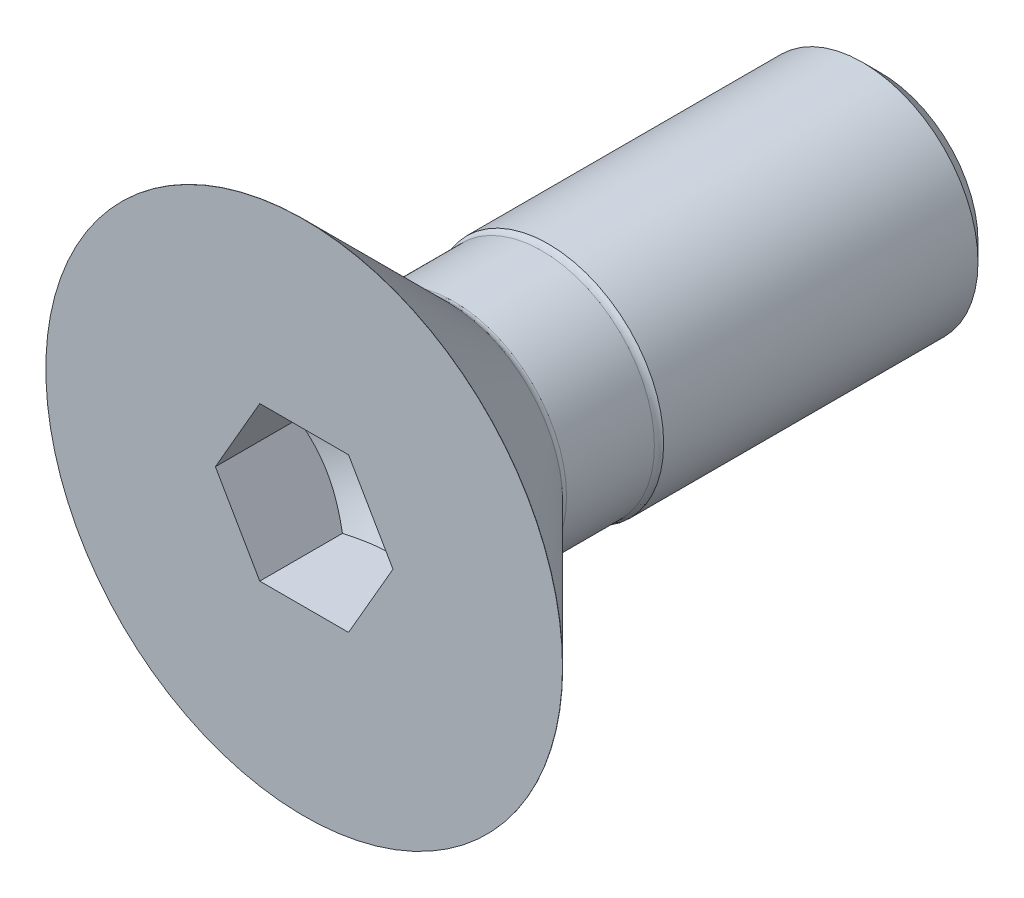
ISO-10303-21;
HEADER;
FILE_DESCRIPTION(('STEP AP214'),'2;1');
FILE_NAME('part.step','',(''),(''),'','','');
FILE_SCHEMA(('AUTOMOTIVE_DESIGN { 1 0 10303 214 1 1 1 1 }'));
ENDSEC;
DATA;
#1=APPLICATION_CONTEXT('core data for automotive mechanical design processes');
#2=APPLICATION_PROTOCOL_DEFINITION('international standard','automotive_design',2000,#1);
#3=PRODUCT_CONTEXT('',#1,'mechanical');
#4=PRODUCT('Part','Part','',(#3));
#5=PRODUCT_RELATED_PRODUCT_CATEGORY('part','',(#4));
#6=PRODUCT_DEFINITION_FORMATION('','',#4);
#7=PRODUCT_DEFINITION_CONTEXT('part definition',#1,'design');
#8=PRODUCT_DEFINITION('design','',#6,#7);
#9=PRODUCT_DEFINITION_SHAPE('','',#8);
#10=(LENGTH_UNIT() NAMED_UNIT(*) SI_UNIT(.MILLI.,.METRE.));
#11=(NAMED_UNIT(*) PLANE_ANGLE_UNIT() SI_UNIT($,.RADIAN.));
#12=(NAMED_UNIT(*) SI_UNIT($,.STERADIAN.) SOLID_ANGLE_UNIT());
#13=UNCERTAINTY_MEASURE_WITH_UNIT(LENGTH_MEASURE(1.E-05),#10,'distance_accuracy_value','');
#14=(GEOMETRIC_REPRESENTATION_CONTEXT(3) GLOBAL_UNCERTAINTY_ASSIGNED_CONTEXT((#13)) GLOBAL_UNIT_ASSIGNED_CONTEXT((#10,
#11,#12)) REPRESENTATION_CONTEXT('',''));
#15=CARTESIAN_POINT('',(0.,0.,0.));
#16=DIRECTION('',(0.,0.,1.));
#17=DIRECTION('',(1.,0.,0.));
#18=AXIS2_PLACEMENT_3D('',#15,#16,#17);
#19=CARTESIAN_POINT('',(0.,13.44,0.));
#20=DIRECTION('',(0.,0.,-1.));
#21=DIRECTION('',(-1.,0.,0.));
#22=AXIS2_PLACEMENT_3D('',#19,#20,#21);
#23=PLANE('',#22);
#24=CARTESIAN_POINT('',(0.,0.,0.));
#25=DIRECTION('',(0.,0.,1.));
#26=DIRECTION('',(1.,0.,0.));
#27=AXIS2_PLACEMENT_3D('',#24,#25,#26);
#28=CIRCLE('',#27,13.44);
#29=CARTESIAN_POINT('',(13.44,0.,0.));
#30=VERTEX_POINT('',#29);
#31=EDGE_CURVE('E106',#30,#30,#28,.T.);
#32=ORIENTED_EDGE('',*,*,#31,.T.);
#33=EDGE_LOOP('',(#32));
#34=FACE_BOUND('',#33,.T.);
#35=DIRECTION('',(0.5,-0.866025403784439,0.));
#36=VECTOR('',#35,1.);
#37=CARTESIAN_POINT('',(2.3094,3.99999813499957,0.));
#38=LINE('',#37,#36);
#39=CARTESIAN_POINT('',(2.3094,3.99999813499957,0.));
#40=VERTEX_POINT('',#39);
#41=CARTESIAN_POINT('',(4.6188,0.,0.));
#42=VERTEX_POINT('',#41);
#43=EDGE_CURVE('E30',#40,#42,#38,.T.);
#44=ORIENTED_EDGE('',*,*,#43,.T.);
#45=DIRECTION('',(-0.5,-0.866025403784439,0.));
#46=VECTOR('',#45,1.);
#47=CARTESIAN_POINT('',(4.6188,0.,0.));
#48=LINE('',#47,#46);
#49=CARTESIAN_POINT('',(2.3094,-3.99999813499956,0.));
#50=VERTEX_POINT('',#49);
#51=EDGE_CURVE('E182',#42,#50,#48,.T.);
#52=ORIENTED_EDGE('',*,*,#51,.T.);
#53=DIRECTION('',(-1.,0.,0.));
#54=VECTOR('',#53,1.);
#55=CARTESIAN_POINT('',(2.3094,-3.99999813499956,0.));
#56=LINE('',#55,#54);
#57=CARTESIAN_POINT('',(-2.3094,-3.99999813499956,0.));
#58=VERTEX_POINT('',#57);
#59=EDGE_CURVE('E237',#50,#58,#56,.T.);
#60=ORIENTED_EDGE('',*,*,#59,.T.);
#61=DIRECTION('',(-0.5,0.866025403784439,0.));
#62=VECTOR('',#61,1.);
#63=CARTESIAN_POINT('',(-2.3094,-3.99999813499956,0.));
#64=LINE('',#63,#62);
#65=CARTESIAN_POINT('',(-4.6188,0.,0.));
#66=VERTEX_POINT('',#65);
#67=EDGE_CURVE('E235',#58,#66,#64,.T.);
#68=ORIENTED_EDGE('',*,*,#67,.T.);
#69=DIRECTION('',(0.5,0.866025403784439,0.));
#70=VECTOR('',#69,1.);
#71=CARTESIAN_POINT('',(-4.6188,0.,0.));
#72=LINE('',#71,#70);
#73=CARTESIAN_POINT('',(-2.3094,3.99999813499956,0.));
#74=VERTEX_POINT('',#73);
#75=EDGE_CURVE('E95',#66,#74,#72,.T.);
#76=ORIENTED_EDGE('',*,*,#75,.T.);
#77=DIRECTION('',(1.,0.,0.));
#78=VECTOR('',#77,1.);
#79=CARTESIAN_POINT('',(-2.3094,3.99999813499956,0.));
#80=LINE('',#79,#78);
#81=EDGE_CURVE('E91',#74,#40,#80,.T.);
#82=ORIENTED_EDGE('',*,*,#81,.T.);
#83=EDGE_LOOP('',(#44,#52,#60,#68,#76,#82));
#84=FACE_BOUND('',#83,.T.);
#85=ADVANCED_FACE('F16',(#34,#84),#23,.F.);
#86=CARTESIAN_POINT('',(0.,0.,-30.));
#87=DIRECTION('',(0.,0.,1.));
#88=DIRECTION('',(1.,0.,0.));
#89=AXIS2_PLACEMENT_3D('',#86,#87,#88);
#90=PLANE('',#89);
#91=CARTESIAN_POINT('',(0.,0.,-30.));
#92=DIRECTION('',(0.,0.,1.));
#93=DIRECTION('',(1.,0.,0.));
#94=AXIS2_PLACEMENT_3D('',#91,#92,#93);
#95=CIRCLE('',#94,5.0528125);
#96=CARTESIAN_POINT('',(5.0528125,0.,-30.));
#97=VERTEX_POINT('',#96);
#98=EDGE_CURVE('E11',#97,#97,#95,.T.);
#99=ORIENTED_EDGE('',*,*,#98,.F.);
#100=EDGE_LOOP('',(#99));
#101=FACE_BOUND('',#100,.T.);
#102=ADVANCED_FACE('F131',(#101),#90,.F.);
#103=CARTESIAN_POINT('',(0.,0.,-30.));
#104=DIRECTION('',(0.,0.,1.));
#105=DIRECTION('',(1.,0.,0.));
#106=AXIS2_PLACEMENT_3D('',#103,#104,#105);
#107=CONICAL_SURFACE('',#106,5.0528125,0.785398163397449);
#108=CARTESIAN_POINT('',(0.,0.,-29.0528125));
#109=DIRECTION('',(0.,0.,1.));
#110=DIRECTION('',(1.,0.,0.));
#111=AXIS2_PLACEMENT_3D('',#108,#109,#110);
#112=CIRCLE('',#111,6.);
#113=CARTESIAN_POINT('',(6.,0.,-29.0528125));
#114=VERTEX_POINT('',#113);
#115=EDGE_CURVE('E23',#114,#114,#112,.T.);
#116=ORIENTED_EDGE('',*,*,#115,.F.);
#117=EDGE_LOOP('',(#116));
#118=FACE_BOUND('',#117,.T.);
#119=ORIENTED_EDGE('',*,*,#98,.T.);
#120=EDGE_LOOP('',(#119));
#121=FACE_BOUND('',#120,.T.);
#122=ADVANCED_FACE('F128',(#118,#121),#107,.T.);
#123=CARTESIAN_POINT('',(0.,0.,0.));
#124=DIRECTION('',(0.,0.,1.));
#125=DIRECTION('',(1.,0.,0.));
#126=AXIS2_PLACEMENT_3D('',#123,#124,#125);
#127=CYLINDRICAL_SURFACE('',#126,6.);
#128=CARTESIAN_POINT('',(0.,0.,-12.7));
#129=DIRECTION('',(0.,0.,1.));
#130=DIRECTION('',(1.,0.,0.));
#131=AXIS2_PLACEMENT_3D('',#128,#129,#130);
#132=CIRCLE('',#131,6.);
#133=CARTESIAN_POINT('',(6.,0.,-12.7));
#134=VERTEX_POINT('',#133);
#135=EDGE_CURVE('E121',#134,#134,#132,.T.);
#136=ORIENTED_EDGE('',*,*,#135,.F.);
#137=EDGE_LOOP('',(#136));
#138=FACE_BOUND('',#137,.T.);
#139=ORIENTED_EDGE('',*,*,#115,.T.);
#140=EDGE_LOOP('',(#139));
#141=FACE_BOUND('',#140,.T.);
#142=ADVANCED_FACE('F126',(#138,#141),#127,.T.);
#143=CARTESIAN_POINT('',(0.,0.,-12.3605887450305));
#144=DIRECTION('',(0.,0.,1.));
#145=DIRECTION('',(1.,0.,0.));
#146=AXIS2_PLACEMENT_3D('',#143,#144,#145);
#147=TOROIDAL_SURFACE('',#146,6.33941125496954,0.48);
#148=ORIENTED_EDGE('',*,*,#135,.T.);
#149=EDGE_LOOP('',(#148));
#150=FACE_BOUND('',#149,.T.);
#151=CARTESIAN_POINT('',(0.,0.,-12.3605887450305));
#152=DIRECTION('',(0.,0.,1.));
#153=DIRECTION('',(1.,0.,0.));
#154=AXIS2_PLACEMENT_3D('',#151,#152,#153);
#155=CIRCLE('',#154,5.85941125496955);
#156=CARTESIAN_POINT('',(5.85941125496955,0.,-12.3605887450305));
#157=VERTEX_POINT('',#156);
#158=EDGE_CURVE('E118',#157,#157,#155,.T.);
#159=ORIENTED_EDGE('',*,*,#158,.F.);
#160=EDGE_LOOP('',(#159));
#161=FACE_BOUND('',#160,.T.);
#162=ADVANCED_FACE('F144',(#150,#161),#147,.F.);
#163=CARTESIAN_POINT('',(0.,0.,0.));
#164=DIRECTION('',(0.,0.,1.));
#165=DIRECTION('',(1.,0.,0.));
#166=AXIS2_PLACEMENT_3D('',#163,#164,#165);
#167=CYLINDRICAL_SURFACE('',#166,5.85941125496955);
#168=CARTESIAN_POINT('',(0.,0.,-7.78941125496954));
#169=DIRECTION('',(0.,0.,1.));
#170=DIRECTION('',(1.,0.,0.));
#171=AXIS2_PLACEMENT_3D('',#168,#169,#170);
#172=CIRCLE('',#171,5.85941125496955);
#173=CARTESIAN_POINT('',(5.85941125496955,0.,-7.78941125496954));
#174=VERTEX_POINT('',#173);
#175=EDGE_CURVE('E115',#174,#174,#172,.T.);
#176=ORIENTED_EDGE('',*,*,#175,.F.);
#177=EDGE_LOOP('',(#176));
#178=FACE_BOUND('',#177,.T.);
#179=ORIENTED_EDGE('',*,*,#158,.T.);
#180=EDGE_LOOP('',(#179));
#181=FACE_BOUND('',#180,.T.);
#182=ADVANCED_FACE('F148',(#178,#181),#167,.T.);
#183=CARTESIAN_POINT('',(0.,0.,-7.78941125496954));
#184=DIRECTION('',(0.,0.,1.));
#185=DIRECTION('',(1.,0.,0.));
#186=AXIS2_PLACEMENT_3D('',#183,#184,#185);
#187=TOROIDAL_SURFACE('',#186,6.33941125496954,0.48);
#188=ORIENTED_EDGE('',*,*,#175,.T.);
#189=EDGE_LOOP('',(#188));
#190=FACE_BOUND('',#189,.T.);
#191=CARTESIAN_POINT('',(0.,0.,-7.45));
#192=DIRECTION('',(0.,0.,1.));
#193=DIRECTION('',(1.,0.,0.));
#194=AXIS2_PLACEMENT_3D('',#191,#192,#193);
#195=CIRCLE('',#194,6.);
#196=CARTESIAN_POINT('',(6.,0.,-7.45));
#197=VERTEX_POINT('',#196);
#198=EDGE_CURVE('E112',#197,#197,#195,.T.);
#199=ORIENTED_EDGE('',*,*,#198,.F.);
#200=EDGE_LOOP('',(#199));
#201=FACE_BOUND('',#200,.T.);
#202=ADVANCED_FACE('F152',(#190,#201),#187,.F.);
#203=CARTESIAN_POINT('',(0.,0.,-7.45));
#204=DIRECTION('',(0.,0.,1.));
#205=DIRECTION('',(1.,0.,0.));
#206=AXIS2_PLACEMENT_3D('',#203,#204,#205);
#207=CONICAL_SURFACE('',#206,6.,0.785398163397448);
#208=CARTESIAN_POINT('',(0.,0.,-0.00999999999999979));
#209=DIRECTION('',(0.,0.,1.));
#210=DIRECTION('',(1.,0.,0.));
#211=AXIS2_PLACEMENT_3D('',#208,#209,#210);
#212=CIRCLE('',#211,13.44);
#213=CARTESIAN_POINT('',(13.44,0.,-0.00999999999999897));
#214=VERTEX_POINT('',#213);
#215=EDGE_CURVE('E109',#214,#214,#212,.T.);
#216=ORIENTED_EDGE('',*,*,#215,.F.);
#217=EDGE_LOOP('',(#216));
#218=FACE_BOUND('',#217,.T.);
#219=ORIENTED_EDGE('',*,*,#198,.T.);
#220=EDGE_LOOP('',(#219));
#221=FACE_BOUND('',#220,.T.);
#222=ADVANCED_FACE('F156',(#218,#221),#207,.T.);
#223=CARTESIAN_POINT('',(0.,0.,0.));
#224=DIRECTION('',(0.,0.,1.));
#225=DIRECTION('',(1.,0.,0.));
#226=AXIS2_PLACEMENT_3D('',#223,#224,#225);
#227=CYLINDRICAL_SURFACE('',#226,13.44);
#228=ORIENTED_EDGE('',*,*,#31,.F.);
#229=EDGE_LOOP('',(#228));
#230=FACE_BOUND('',#229,.T.);
#231=ORIENTED_EDGE('',*,*,#215,.T.);
#232=EDGE_LOOP('',(#231));
#233=FACE_BOUND('',#232,.T.);
#234=ADVANCED_FACE('F160',(#230,#233),#227,.T.);
#235=CARTESIAN_POINT('',(2.3094,3.99999813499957,-6.96666542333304));
#236=DIRECTION('',(-0.866025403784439,-0.5,0.));
#237=DIRECTION('',(-0.5,0.866025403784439,0.));
#238=AXIS2_PLACEMENT_3D('',#235,#236,#237);
#239=PLANE('',#238);
#240=DIRECTION('',(0.,0.,1.));
#241=VECTOR('',#240,1.);
#242=CARTESIAN_POINT('',(4.6188,0.,-6.96666542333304));
#243=LINE('',#242,#241);
#244=CARTESIAN_POINT('',(4.6188,0.,-4.3));
#245=VERTEX_POINT('',#244);
#246=EDGE_CURVE('E104',#245,#42,#243,.T.);
#247=ORIENTED_EDGE('',*,*,#246,.T.);
#248=ORIENTED_EDGE('',*,*,#43,.F.);
#249=DIRECTION('',(0.,0.,1.));
#250=VECTOR('',#249,1.);
#251=CARTESIAN_POINT('',(2.3094,3.99999813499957,-6.96666542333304));
#252=LINE('',#251,#250);
#253=CARTESIAN_POINT('',(2.3094,3.99999813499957,-4.3));
#254=VERTEX_POINT('',#253);
#255=EDGE_CURVE('E85',#254,#40,#252,.T.);
#256=ORIENTED_EDGE('',*,*,#255,.F.);
#257=CARTESIAN_POINT('',(4.61880011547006,-2.E-07,-4.29999993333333));
#258=CARTESIAN_POINT('',(4.51731596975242,0.175775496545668,-4.35860882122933));
#259=CARTESIAN_POINT('',(4.41495581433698,0.353068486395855,-4.41191053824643));
#260=CARTESIAN_POINT('',(4.20846320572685,0.710724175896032,-4.5049470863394));
#261=CARTESIAN_POINT('',(4.10432708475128,0.891093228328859,-4.54464900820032));
#262=CARTESIAN_POINT('',(3.89734534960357,1.24959610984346,-4.60644791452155));
#263=CARTESIAN_POINT('',(3.79453157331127,1.42767479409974,-4.62895625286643));
#264=CARTESIAN_POINT('',(3.58842050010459,1.78466964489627,-4.65582149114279));
#265=CARTESIAN_POINT('',(3.48512395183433,1.96358451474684,-4.66020064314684));
#266=CARTESIAN_POINT('',(3.29212541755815,2.29786778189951,-4.651067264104));
#267=CARTESIAN_POINT('',(3.20239447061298,2.45328634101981,-4.63979728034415));
#268=CARTESIAN_POINT('',(3.02351714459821,2.76311095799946,-4.60408526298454));
#269=CARTESIAN_POINT('',(2.93437138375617,2.91751594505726,-4.57963104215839));
#270=CARTESIAN_POINT('',(2.75512555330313,3.2279788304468,-4.51850022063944));
#271=CARTESIAN_POINT('',(2.66504815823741,3.38399745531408,-4.48156461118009));
#272=CARTESIAN_POINT('',(2.48623648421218,3.69370835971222,-4.39773639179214));
#273=CARTESIAN_POINT('',(2.39749991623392,3.84740460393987,-4.35086346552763));
#274=CARTESIAN_POINT('',(2.30939988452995,3.99999833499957,-4.29999993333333));
#275=B_SPLINE_CURVE_WITH_KNOTS('',3,(#257,#258,#259,#260,#261,#262,#263,#264,#265,#266,#267,
#268,#269,#270,#271,#272,#273,#274),.UNSPECIFIED.,.F.,.F.,(4,2,2,2,2,2,2,2,4),(0.,
0.634031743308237,1.26958707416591,1.88941437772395,2.50848066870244,3.047414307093,
3.58684698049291,4.13824168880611,4.6885542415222),.UNSPECIFIED.);
#276=EDGE_CURVE('E78',#245,#254,#275,.T.);
#277=ORIENTED_EDGE('',*,*,#276,.F.);
#278=EDGE_LOOP('',(#247,#248,#256,#277));
#279=FACE_BOUND('',#278,.T.);
#280=ADVANCED_FACE('F86',(#279),#239,.T.);
#281=CARTESIAN_POINT('',(4.6188,0.,-6.96666542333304));
#282=DIRECTION('',(-0.866025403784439,0.5,0.));
#283=DIRECTION('',(0.5,0.866025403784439,0.));
#284=AXIS2_PLACEMENT_3D('',#281,#282,#283);
#285=PLANE('',#284);
#286=DIRECTION('',(0.,0.,1.));
#287=VECTOR('',#286,1.);
#288=CARTESIAN_POINT('',(2.3094,-3.99999813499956,-6.96666542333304));
#289=LINE('',#288,#287);
#290=CARTESIAN_POINT('',(2.3094,-3.99999813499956,-4.3));
#291=VERTEX_POINT('',#290);
#292=EDGE_CURVE('E102',#291,#50,#289,.T.);
#293=ORIENTED_EDGE('',*,*,#292,.T.);
#294=ORIENTED_EDGE('',*,*,#51,.F.);
#295=ORIENTED_EDGE('',*,*,#246,.F.);
#296=CARTESIAN_POINT('',(2.30939988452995,-3.99999833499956,-4.29999993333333));
#297=CARTESIAN_POINT('',(2.41088403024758,-3.8242226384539,-4.35860882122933));
#298=CARTESIAN_POINT('',(2.51324418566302,-3.64692964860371,-4.41191053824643));
#299=CARTESIAN_POINT('',(2.71973679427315,-3.28927395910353,-4.5049470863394));
#300=CARTESIAN_POINT('',(2.82387291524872,-3.10890490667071,-4.54464900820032));
#301=CARTESIAN_POINT('',(3.03085465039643,-2.75040202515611,-4.60644791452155));
#302=CARTESIAN_POINT('',(3.13366842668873,-2.57232334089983,-4.62895625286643));
#303=CARTESIAN_POINT('',(3.33977949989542,-2.2153284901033,-4.65582149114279));
#304=CARTESIAN_POINT('',(3.44307604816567,-2.03641362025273,-4.66020064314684));
#305=CARTESIAN_POINT('',(3.63607458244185,-1.70213035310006,-4.651067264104));
#306=CARTESIAN_POINT('',(3.72580552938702,-1.54671179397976,-4.63979728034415));
#307=CARTESIAN_POINT('',(3.90468285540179,-1.23688717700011,-4.60408526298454));
#308=CARTESIAN_POINT('',(3.99382861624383,-1.08248218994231,-4.57963104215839));
#309=CARTESIAN_POINT('',(4.17307444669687,-0.772019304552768,-4.51850022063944));
#310=CARTESIAN_POINT('',(4.26315184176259,-0.616000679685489,-4.48156461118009));
#311=CARTESIAN_POINT('',(4.44196351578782,-0.306289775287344,-4.39773639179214));
#312=CARTESIAN_POINT('',(4.53070008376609,-0.152593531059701,-4.35086346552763));
#313=CARTESIAN_POINT('',(4.61880011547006,2.00000000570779E-07,-4.29999993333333));
#314=B_SPLINE_CURVE_WITH_KNOTS('',3,(#296,#297,#298,#299,#300,#301,#302,#303,#304,#305,#306,
#307,#308,#309,#310,#311,#312,#313),.UNSPECIFIED.,.F.,.F.,(4,2,2,2,2,2,2,2,4),(0.,
0.634031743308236,1.26958707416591,1.88941437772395,2.50848066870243,3.04741430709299,
3.58684698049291,4.13824168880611,4.6885542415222),.UNSPECIFIED.);
#315=EDGE_CURVE('E82',#291,#245,#314,.T.);
#316=ORIENTED_EDGE('',*,*,#315,.F.);
#317=EDGE_LOOP('',(#293,#294,#295,#316));
#318=FACE_BOUND('',#317,.T.);
#319=ADVANCED_FACE('F168',(#318),#285,.T.);
#320=CARTESIAN_POINT('',(2.3094,-3.99999813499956,-6.96666542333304));
#321=DIRECTION('',(0.,1.,0.));
#322=DIRECTION('',(1.,0.,0.));
#323=AXIS2_PLACEMENT_3D('',#320,#321,#322);
#324=PLANE('',#323);
#325=DIRECTION('',(0.,0.,1.));
#326=VECTOR('',#325,1.);
#327=CARTESIAN_POINT('',(-2.3094,-3.99999813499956,-6.96666542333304));
#328=LINE('',#327,#326);
#329=CARTESIAN_POINT('',(-2.3094,-3.99999813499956,-4.3));
#330=VERTEX_POINT('',#329);
#331=EDGE_CURVE('E100',#330,#58,#328,.T.);
#332=ORIENTED_EDGE('',*,*,#331,.T.);
#333=ORIENTED_EDGE('',*,*,#59,.F.);
#334=ORIENTED_EDGE('',*,*,#292,.F.);
#335=CARTESIAN_POINT('',(-5.98057769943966,-3.99999813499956,-2.81265953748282));
#336=CARTESIAN_POINT('',(-5.80784400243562,-3.99999813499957,-2.89553062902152));
#337=CARTESIAN_POINT('',(-5.63468950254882,-3.99999813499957,-2.9775409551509));
#338=CARTESIAN_POINT('',(-5.28731462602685,-3.99999813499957,-3.13935177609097));
#339=CARTESIAN_POINT('',(-5.11309406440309,-3.99999813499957,-3.21915187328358));
#340=CARTESIAN_POINT('',(-4.76236385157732,-3.99999813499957,-3.37649974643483));
#341=CARTESIAN_POINT('',(-4.58584672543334,-3.99999813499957,-3.45403092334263));
#342=CARTESIAN_POINT('',(-4.23133125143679,-3.99999813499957,-3.60561658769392));
#343=CARTESIAN_POINT('',(-4.05333298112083,-3.99999813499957,-3.67967125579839));
#344=CARTESIAN_POINT('',(-3.69088328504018,-3.99999813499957,-3.82526388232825));
#345=CARTESIAN_POINT('',(-3.50638481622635,-3.99999813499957,-3.89668541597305));
#346=CARTESIAN_POINT('',(-3.13515624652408,-3.99999813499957,-4.03359043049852));
#347=CARTESIAN_POINT('',(-2.94842588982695,-3.99999813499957,-4.09907322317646));
#348=CARTESIAN_POINT('',(-2.57285948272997,-3.99999813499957,-4.22223088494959));
#349=CARTESIAN_POINT('',(-2.38402930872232,-3.99999813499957,-4.27992348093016));
#350=CARTESIAN_POINT('',(-2.00367935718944,-3.99999813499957,-4.38551950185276));
#351=CARTESIAN_POINT('',(-1.8121605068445,-3.99999813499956,-4.43342621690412));
#352=CARTESIAN_POINT('',(-1.42680740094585,-3.99999813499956,-4.51690509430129));
#353=CARTESIAN_POINT('',(-1.23297862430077,-3.99999813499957,-4.55250205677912));
#354=CARTESIAN_POINT('',(-0.843152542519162,-3.99999813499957,-4.60902756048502));
#355=CARTESIAN_POINT('',(-0.647155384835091,-3.99999813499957,-4.62995709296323));
#356=CARTESIAN_POINT('',(-0.256426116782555,-3.99999813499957,-4.65520588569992));
#357=CARTESIAN_POINT('',(-0.0617069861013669,-3.99999813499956,-4.65972115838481));
#358=CARTESIAN_POINT('',(0.327426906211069,-3.99999813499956,-4.6522625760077));
#359=CARTESIAN_POINT('',(0.521841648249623,-3.99999813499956,-4.64028769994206));
#360=CARTESIAN_POINT('',(0.858491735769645,-3.99999813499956,-4.6060809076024));
#361=CARTESIAN_POINT('',(1.00109922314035,-3.99999813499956,-4.58734280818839));
#362=CARTESIAN_POINT('',(1.28511976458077,-3.99999813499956,-4.54228330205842));
#363=CARTESIAN_POINT('',(1.42653262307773,-3.99999813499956,-4.51596067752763));
#364=CARTESIAN_POINT('',(1.84886975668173,-3.99999813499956,-4.42701633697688));
#365=CARTESIAN_POINT('',(2.12771265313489,-3.99999813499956,-4.35443869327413));
#366=CARTESIAN_POINT('',(2.5446328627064,-3.99999813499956,-4.23045460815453));
#367=CARTESIAN_POINT('',(2.68490831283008,-3.99999813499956,-4.18603482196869));
#368=CARTESIAN_POINT('',(2.9640950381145,-3.99999813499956,-4.09305928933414));
#369=CARTESIAN_POINT('',(3.10300630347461,-3.99999813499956,-4.04450351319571));
#370=CARTESIAN_POINT('',(3.37952018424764,-3.99999813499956,-3.94399512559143));
#371=CARTESIAN_POINT('',(3.5171233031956,-3.99999813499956,-3.89204388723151));
#372=CARTESIAN_POINT('',(3.79122042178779,-3.99999813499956,-3.78530773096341));
#373=CARTESIAN_POINT('',(3.92771443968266,-3.99999813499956,-3.73052285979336));
#374=CARTESIAN_POINT('',(4.27613178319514,-3.99999813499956,-3.58716685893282));
#375=CARTESIAN_POINT('',(4.48735789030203,-3.99999813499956,-3.49690336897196));
#376=CARTESIAN_POINT('',(4.90790709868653,-3.99999813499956,-3.31203406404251));
#377=CARTESIAN_POINT('',(5.11723005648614,-3.99999813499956,-3.21742792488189));
#378=CARTESIAN_POINT('',(5.53437999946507,-3.99999813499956,-3.02485320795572));
#379=CARTESIAN_POINT('',(5.74220661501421,-3.99999813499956,-2.92688383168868));
#380=CARTESIAN_POINT('',(6.15660816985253,-3.99999813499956,-2.72832859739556));
#381=CARTESIAN_POINT('',(6.36318308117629,-3.99999813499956,-2.62774268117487));
#382=CARTESIAN_POINT('',(6.98187215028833,-3.99999813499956,-2.32266766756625));
#383=CARTESIAN_POINT('',(7.39246201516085,-3.99999813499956,-2.11509025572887));
#384=CARTESIAN_POINT('',(8.21082346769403,-3.99999813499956,-1.69463026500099));
#385=CARTESIAN_POINT('',(8.6185954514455,-3.99999813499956,-1.48174845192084));
#386=CARTESIAN_POINT('',(9.39379812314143,-3.99999813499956,-1.07256649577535));
#387=CARTESIAN_POINT('',(9.76140395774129,-3.99999813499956,-0.87659763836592));
#388=CARTESIAN_POINT('',(10.4954352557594,-3.99999813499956,-0.482427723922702));
#389=CARTESIAN_POINT('',(10.861860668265,-3.99999813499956,-0.28422657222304));
#390=CARTESIAN_POINT('',(11.5928695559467,-3.99999813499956,0.113342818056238));
#391=CARTESIAN_POINT('',(11.9574553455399,-3.99999813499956,0.31270680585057));
#392=CARTESIAN_POINT('',(12.6858878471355,-3.99999813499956,0.712731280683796));
#393=CARTESIAN_POINT('',(13.049734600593,-3.99999813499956,0.913391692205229));
#394=CARTESIAN_POINT('',(13.4133165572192,-3.99999813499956,1.11452768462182));
#395=B_SPLINE_CURVE_WITH_KNOTS('',3,(#335,#336,#337,#338,#339,#340,#341,#342,#343,#344,#345,
#346,#347,#348,#349,#350,#351,#352,#353,#354,#355,#356,#357,#358,#359,#360,#361,#362,#363,#364,
#365,#366,#367,#368,#369,#370,#371,#372,#373,#374,#375,#376,#377,#378,#379,#380,#381,#382,#383,
#384,#385,#386,#387,#388,#389,#390,#391,#392,#393,#394),.UNSPECIFIED.,.F.,.F.,(4,2,2,2,2,2,2,2,
2,2,2,2,2,2,2,2,2,2,2,2,2,2,2,2,2,2,2,2,2,4),(0.,0.574761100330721,1.14962493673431,
1.7279759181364,2.30629681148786,2.89973831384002,3.49324849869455,4.08538451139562,
4.67732111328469,5.26805811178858,5.85875518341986,6.44237478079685,7.02603051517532,
7.45731714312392,7.88867305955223,8.75192580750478,9.19331611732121,9.63470959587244,
10.0759256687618,10.5171344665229,11.2061762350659,11.8952695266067,12.5845275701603,
13.2738009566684,14.6539662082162,16.0339333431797,17.2836591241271,18.5334381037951,
19.7800382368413,21.0265663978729),.UNSPECIFIED.);
#396=EDGE_CURVE('E210',#330,#291,#395,.T.);
#397=ORIENTED_EDGE('',*,*,#396,.F.);
#398=EDGE_LOOP('',(#332,#333,#334,#397));
#399=FACE_BOUND('',#398,.T.);
#400=ADVANCED_FACE('F215',(#399),#324,.T.);
#401=CARTESIAN_POINT('',(-2.3094,-3.99999813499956,-6.96666542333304));
#402=DIRECTION('',(0.866025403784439,0.5,0.));
#403=DIRECTION('',(0.5,-0.866025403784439,0.));
#404=AXIS2_PLACEMENT_3D('',#401,#402,#403);
#405=PLANE('',#404);
#406=DIRECTION('',(0.,0.,1.));
#407=VECTOR('',#406,1.);
#408=CARTESIAN_POINT('',(-4.6188,0.,-6.96666542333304));
#409=LINE('',#408,#407);
#410=CARTESIAN_POINT('',(-4.6188,0.,-4.3));
#411=VERTEX_POINT('',#410);
#412=EDGE_CURVE('E93',#411,#66,#409,.T.);
#413=ORIENTED_EDGE('',*,*,#412,.T.);
#414=ORIENTED_EDGE('',*,*,#67,.F.);
#415=ORIENTED_EDGE('',*,*,#331,.F.);
#416=CARTESIAN_POINT('',(-4.61880011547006,2.00000001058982E-07,-4.29999993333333));
#417=CARTESIAN_POINT('',(-4.51731596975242,-0.175775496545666,-4.35860882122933));
#418=CARTESIAN_POINT('',(-4.41495581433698,-0.353068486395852,-4.41191053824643));
#419=CARTESIAN_POINT('',(-4.20846320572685,-0.710724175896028,-4.5049470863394));
#420=CARTESIAN_POINT('',(-4.10432708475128,-0.891093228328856,-4.54464900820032));
#421=CARTESIAN_POINT('',(-3.89734534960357,-1.24959610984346,-4.60644791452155));
#422=CARTESIAN_POINT('',(-3.79453157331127,-1.42767479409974,-4.62895625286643));
#423=CARTESIAN_POINT('',(-3.58842050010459,-1.78466964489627,-4.65582149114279));
#424=CARTESIAN_POINT('',(-3.48512395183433,-1.96358451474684,-4.66020064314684));
#425=CARTESIAN_POINT('',(-3.29212541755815,-2.2978677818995,-4.651067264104));
#426=CARTESIAN_POINT('',(-3.20239447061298,-2.45328634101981,-4.63979728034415));
#427=CARTESIAN_POINT('',(-3.02351714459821,-2.76311095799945,-4.60408526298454));
#428=CARTESIAN_POINT('',(-2.93437138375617,-2.91751594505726,-4.57963104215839));
#429=CARTESIAN_POINT('',(-2.75512555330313,-3.2279788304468,-4.51850022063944));
#430=CARTESIAN_POINT('',(-2.66504815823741,-3.38399745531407,-4.48156461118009));
#431=CARTESIAN_POINT('',(-2.48623648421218,-3.69370835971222,-4.39773639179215));
#432=CARTESIAN_POINT('',(-2.39749991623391,-3.84740460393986,-4.35086346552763));
#433=CARTESIAN_POINT('',(-2.30939988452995,-3.99999833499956,-4.29999993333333));
#434=B_SPLINE_CURVE_WITH_KNOTS('',3,(#416,#417,#418,#419,#420,#421,#422,#423,#424,#425,#426,
#427,#428,#429,#430,#431,#432,#433),.UNSPECIFIED.,.F.,.F.,(4,2,2,2,2,2,2,2,4),(0.,
0.634031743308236,1.26958707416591,1.88941437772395,2.50848066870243,3.04741430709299,
3.58684698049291,4.13824168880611,4.6885542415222),.UNSPECIFIED.);
#435=EDGE_CURVE('E204',#411,#330,#434,.T.);
#436=ORIENTED_EDGE('',*,*,#435,.F.);
#437=EDGE_LOOP('',(#413,#414,#415,#436));
#438=FACE_BOUND('',#437,.T.);
#439=ADVANCED_FACE('F218',(#438),#405,.T.);
#440=CARTESIAN_POINT('',(-4.6188,0.,-6.96666542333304));
#441=DIRECTION('',(0.866025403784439,-0.5,0.));
#442=DIRECTION('',(-0.5,-0.866025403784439,0.));
#443=AXIS2_PLACEMENT_3D('',#440,#441,#442);
#444=PLANE('',#443);
#445=DIRECTION('',(0.,0.,1.));
#446=VECTOR('',#445,1.);
#447=CARTESIAN_POINT('',(-2.3094,3.99999813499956,-6.96666542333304));
#448=LINE('',#447,#446);
#449=CARTESIAN_POINT('',(-2.3094,3.99999813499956,-4.3));
#450=VERTEX_POINT('',#449);
#451=EDGE_CURVE('E90',#450,#74,#448,.T.);
#452=ORIENTED_EDGE('',*,*,#451,.T.);
#453=ORIENTED_EDGE('',*,*,#75,.F.);
#454=ORIENTED_EDGE('',*,*,#412,.F.);
#455=CARTESIAN_POINT('',(-2.30939988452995,3.99999833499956,-4.29999993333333));
#456=CARTESIAN_POINT('',(-2.41088403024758,3.82422263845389,-4.35860882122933));
#457=CARTESIAN_POINT('',(-2.51324418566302,3.64692964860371,-4.41191053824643));
#458=CARTESIAN_POINT('',(-2.71973679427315,3.28927395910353,-4.5049470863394));
#459=CARTESIAN_POINT('',(-2.82387291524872,3.1089049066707,-4.54464900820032));
#460=CARTESIAN_POINT('',(-3.03085465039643,2.7504020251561,-4.60644791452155));
#461=CARTESIAN_POINT('',(-3.13366842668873,2.57232334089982,-4.62895625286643));
#462=CARTESIAN_POINT('',(-3.33977949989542,2.21532849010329,-4.65582149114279));
#463=CARTESIAN_POINT('',(-3.44307604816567,2.03641362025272,-4.66020064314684));
#464=CARTESIAN_POINT('',(-3.63607458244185,1.70213035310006,-4.651067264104));
#465=CARTESIAN_POINT('',(-3.72580552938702,1.54671179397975,-4.63979728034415));
#466=CARTESIAN_POINT('',(-3.90468285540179,1.23688717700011,-4.60408526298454));
#467=CARTESIAN_POINT('',(-3.99382861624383,1.08248218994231,-4.57963104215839));
#468=CARTESIAN_POINT('',(-4.17307444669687,0.77201930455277,-4.51850022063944));
#469=CARTESIAN_POINT('',(-4.26315184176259,0.616000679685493,-4.48156461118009));
#470=CARTESIAN_POINT('',(-4.44196351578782,0.306289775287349,-4.39773639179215));
#471=CARTESIAN_POINT('',(-4.53070008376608,0.152593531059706,-4.35086346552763));
#472=CARTESIAN_POINT('',(-4.61880011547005,-1.9999999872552E-07,-4.29999993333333));
#473=B_SPLINE_CURVE_WITH_KNOTS('',3,(#455,#456,#457,#458,#459,#460,#461,#462,#463,#464,#465,
#466,#467,#468,#469,#470,#471,#472),.UNSPECIFIED.,.F.,.F.,(4,2,2,2,2,2,2,2,4),(0.,
0.634031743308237,1.26958707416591,1.88941437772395,2.50848066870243,3.04741430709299,
3.58684698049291,4.1382416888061,4.68855424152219),.UNSPECIFIED.);
#474=EDGE_CURVE('E38',#450,#411,#473,.T.);
#475=ORIENTED_EDGE('',*,*,#474,.F.);
#476=EDGE_LOOP('',(#452,#453,#454,#475));
#477=FACE_BOUND('',#476,.T.);
#478=ADVANCED_FACE('F222',(#477),#444,.T.);
#479=CARTESIAN_POINT('',(-2.3094,3.99999813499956,-6.96666542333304));
#480=DIRECTION('',(0.,-1.,0.));
#481=DIRECTION('',(-1.,0.,0.));
#482=AXIS2_PLACEMENT_3D('',#479,#480,#481);
#483=PLANE('',#482);
#484=ORIENTED_EDGE('',*,*,#255,.T.);
#485=ORIENTED_EDGE('',*,*,#81,.F.);
#486=ORIENTED_EDGE('',*,*,#451,.F.);
#487=CARTESIAN_POINT('',(-5.98057769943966,3.99999813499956,-2.81265953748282));
#488=CARTESIAN_POINT('',(-5.80784400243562,3.99999813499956,-2.89553062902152));
#489=CARTESIAN_POINT('',(-5.63468950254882,3.99999813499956,-2.9775409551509));
#490=CARTESIAN_POINT('',(-5.28731462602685,3.99999813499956,-3.13935177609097));
#491=CARTESIAN_POINT('',(-5.11309406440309,3.99999813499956,-3.21915187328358));
#492=CARTESIAN_POINT('',(-4.76236385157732,3.99999813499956,-3.37649974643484));
#493=CARTESIAN_POINT('',(-4.58584672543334,3.99999813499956,-3.45403092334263));
#494=CARTESIAN_POINT('',(-4.23133125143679,3.99999813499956,-3.60561658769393));
#495=CARTESIAN_POINT('',(-4.05333298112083,3.99999813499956,-3.6796712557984));
#496=CARTESIAN_POINT('',(-3.69088328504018,3.99999813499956,-3.82526388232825));
#497=CARTESIAN_POINT('',(-3.50638481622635,3.99999813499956,-3.89668541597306));
#498=CARTESIAN_POINT('',(-3.13515624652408,3.99999813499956,-4.03359043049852));
#499=CARTESIAN_POINT('',(-2.94842588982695,3.99999813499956,-4.09907322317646));
#500=CARTESIAN_POINT('',(-2.57285948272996,3.99999813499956,-4.22223088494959));
#501=CARTESIAN_POINT('',(-2.38402930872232,3.99999813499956,-4.27992348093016));
#502=CARTESIAN_POINT('',(-2.00367935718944,3.99999813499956,-4.38551950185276));
#503=CARTESIAN_POINT('',(-1.8121605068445,3.99999813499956,-4.43342621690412));
#504=CARTESIAN_POINT('',(-1.42680740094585,3.99999813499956,-4.51690509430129));
#505=CARTESIAN_POINT('',(-1.23297862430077,3.99999813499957,-4.55250205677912));
#506=CARTESIAN_POINT('',(-0.843152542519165,3.99999813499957,-4.60902756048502));
#507=CARTESIAN_POINT('',(-0.647155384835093,3.99999813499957,-4.62995709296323));
#508=CARTESIAN_POINT('',(-0.256426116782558,3.99999813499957,-4.65520588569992));
#509=CARTESIAN_POINT('',(-0.0617069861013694,3.99999813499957,-4.65972115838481));
#510=CARTESIAN_POINT('',(0.327426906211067,3.99999813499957,-4.6522625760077));
#511=CARTESIAN_POINT('',(0.52184164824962,3.99999813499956,-4.64028769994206));
#512=CARTESIAN_POINT('',(0.858491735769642,3.99999813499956,-4.6060809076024));
#513=CARTESIAN_POINT('',(1.00109922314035,3.99999813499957,-4.58734280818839));
#514=CARTESIAN_POINT('',(1.28511976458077,3.99999813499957,-4.54228330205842));
#515=CARTESIAN_POINT('',(1.42653262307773,3.99999813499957,-4.51596067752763));
#516=CARTESIAN_POINT('',(1.84886975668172,3.99999813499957,-4.42701633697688));
#517=CARTESIAN_POINT('',(2.12771265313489,3.99999813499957,-4.35443869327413));
#518=CARTESIAN_POINT('',(2.5446328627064,3.99999813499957,-4.23045460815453));
#519=CARTESIAN_POINT('',(2.68490831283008,3.99999813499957,-4.18603482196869));
#520=CARTESIAN_POINT('',(2.9640950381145,3.99999813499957,-4.09305928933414));
#521=CARTESIAN_POINT('',(3.10300630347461,3.99999813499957,-4.04450351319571));
#522=CARTESIAN_POINT('',(3.37952018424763,3.99999813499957,-3.94399512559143));
#523=CARTESIAN_POINT('',(3.5171233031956,3.99999813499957,-3.89204388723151));
#524=CARTESIAN_POINT('',(3.79122042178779,3.99999813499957,-3.78530773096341));
#525=CARTESIAN_POINT('',(3.92771443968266,3.99999813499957,-3.73052285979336));
#526=CARTESIAN_POINT('',(4.27613178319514,3.99999813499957,-3.58716685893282));
#527=CARTESIAN_POINT('',(4.48735789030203,3.99999813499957,-3.49690336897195));
#528=CARTESIAN_POINT('',(4.90790709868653,3.99999813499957,-3.3120340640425));
#529=CARTESIAN_POINT('',(5.11723005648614,3.99999813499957,-3.21742792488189));
#530=CARTESIAN_POINT('',(5.53437999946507,3.99999813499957,-3.02485320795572));
#531=CARTESIAN_POINT('',(5.74220661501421,3.99999813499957,-2.92688383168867));
#532=CARTESIAN_POINT('',(6.15660816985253,3.99999813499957,-2.72832859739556));
#533=CARTESIAN_POINT('',(6.36318308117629,3.99999813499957,-2.62774268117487));
#534=CARTESIAN_POINT('',(6.98187215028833,3.99999813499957,-2.32266766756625));
#535=CARTESIAN_POINT('',(7.39246201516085,3.99999813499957,-2.11509025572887));
#536=CARTESIAN_POINT('',(8.21082346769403,3.99999813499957,-1.69463026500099));
#537=CARTESIAN_POINT('',(8.6185954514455,3.99999813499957,-1.48174845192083));
#538=CARTESIAN_POINT('',(9.39379812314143,3.99999813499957,-1.07256649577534));
#539=CARTESIAN_POINT('',(9.7614039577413,3.99999813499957,-0.876597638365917));
#540=CARTESIAN_POINT('',(10.4954352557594,3.99999813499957,-0.482427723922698));
#541=CARTESIAN_POINT('',(10.861860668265,3.99999813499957,-0.284226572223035));
#542=CARTESIAN_POINT('',(11.5928695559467,3.99999813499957,0.113342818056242));
#543=CARTESIAN_POINT('',(11.9574553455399,3.99999813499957,0.312706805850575));
#544=CARTESIAN_POINT('',(12.6858878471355,3.99999813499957,0.712731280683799));
#545=CARTESIAN_POINT('',(13.049734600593,3.99999813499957,0.91339169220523));
#546=CARTESIAN_POINT('',(13.4133165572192,3.99999813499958,1.11452768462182));
#547=B_SPLINE_CURVE_WITH_KNOTS('',3,(#487,#488,#489,#490,#491,#492,#493,#494,#495,#496,#497,
#498,#499,#500,#501,#502,#503,#504,#505,#506,#507,#508,#509,#510,#511,#512,#513,#514,#515,#516,
#517,#518,#519,#520,#521,#522,#523,#524,#525,#526,#527,#528,#529,#530,#531,#532,#533,#534,#535,
#536,#537,#538,#539,#540,#541,#542,#543,#544,#545,#546),.UNSPECIFIED.,.F.,.F.,(4,2,2,2,2,2,2,2,
2,2,2,2,2,2,2,2,2,2,2,2,2,2,2,2,2,2,2,2,2,4),(0.,0.574761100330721,1.14962493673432,
1.7279759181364,2.30629681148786,2.89973831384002,3.49324849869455,4.08538451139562,
4.67732111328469,5.26805811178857,5.85875518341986,6.44237478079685,7.02603051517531,
7.45731714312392,7.88867305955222,8.75192580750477,9.19331611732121,9.63470959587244,
10.0759256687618,10.5171344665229,11.2061762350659,11.8952695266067,12.5845275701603,
13.2738009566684,14.6539662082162,16.0339333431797,17.2836591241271,18.5334381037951,
19.7800382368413,21.0265663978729),.UNSPECIFIED.);
#548=EDGE_CURVE('E79',#254,#450,#547,.F.);
#549=ORIENTED_EDGE('',*,*,#548,.F.);
#550=EDGE_LOOP('',(#484,#485,#486,#549));
#551=FACE_BOUND('',#550,.T.);
#552=ADVANCED_FACE('F74',(#551),#483,.T.);
#553=CARTESIAN_POINT('',(0.,0.,-6.96666542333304));
#554=DIRECTION('',(0.,0.,1.));
#555=DIRECTION('',(1.,0.,0.));
#556=AXIS2_PLACEMENT_3D('',#553,#554,#555);
#557=CONICAL_SURFACE('',#556,0.,1.0471975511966);
#558=CARTESIAN_POINT('',(0.,0.,-6.96666542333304));
#559=VERTEX_POINT('',#558);
#560=VERTEX_LOOP('',#559);
#561=FACE_BOUND('',#560,.T.);
#562=ORIENTED_EDGE('',*,*,#276,.T.);
#563=ORIENTED_EDGE('',*,*,#548,.T.);
#564=ORIENTED_EDGE('',*,*,#474,.T.);
#565=ORIENTED_EDGE('',*,*,#435,.T.);
#566=ORIENTED_EDGE('',*,*,#396,.T.);
#567=ORIENTED_EDGE('',*,*,#315,.T.);
#568=EDGE_LOOP('',(#562,#563,#564,#565,#566,#567));
#569=FACE_BOUND('',#568,.T.);
#570=ADVANCED_FACE('F71',(#561,#569),#557,.F.);
#571=CLOSED_SHELL('',(#85,#102,#122,#142,#162,#182,#202,#222,#234,#280,#319,#400,#439,#478,#552,#570));
#572=MANIFOLD_SOLID_BREP('B1',#571);
#573=ADVANCED_BREP_SHAPE_REPRESENTATION('',(#18,#572),#14);
#574=SHAPE_DEFINITION_REPRESENTATION(#9,#573);
ENDSEC;
END-ISO-10303-21;
